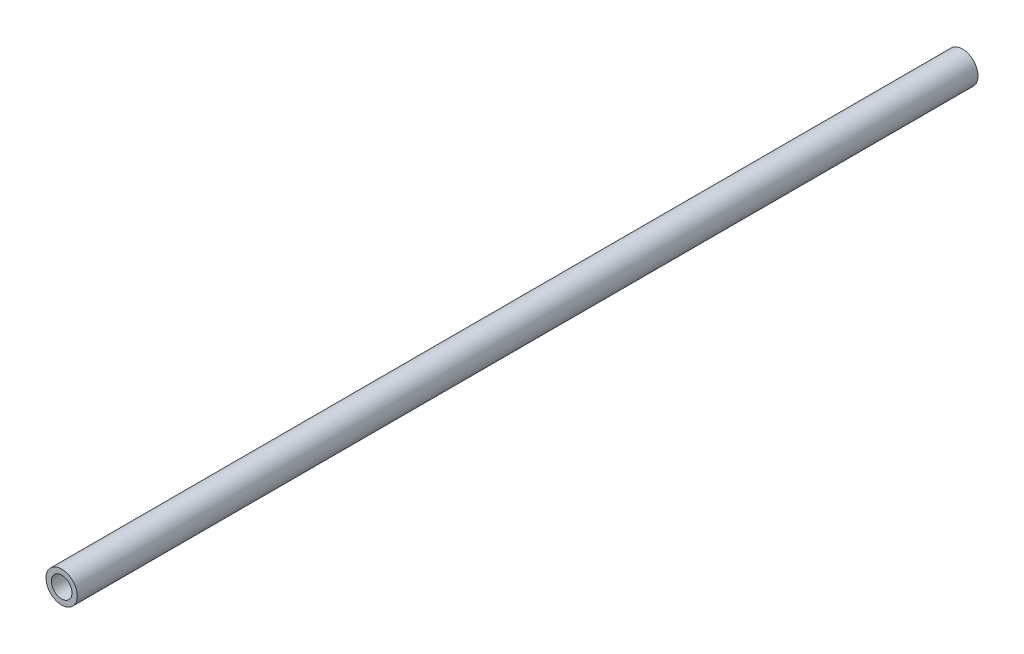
ISO-10303-21;
HEADER;
FILE_DESCRIPTION(('STEP AP214'),'2;1');
FILE_NAME('part.step','',(''),(''),'','','');
FILE_SCHEMA(('AUTOMOTIVE_DESIGN { 1 0 10303 214 1 1 1 1 }'));
ENDSEC;
DATA;
#1=APPLICATION_CONTEXT('core data for automotive mechanical design processes');
#2=APPLICATION_PROTOCOL_DEFINITION('international standard','automotive_design',2000,#1);
#3=PRODUCT_CONTEXT('',#1,'mechanical');
#4=PRODUCT('Part','Part','',(#3));
#5=PRODUCT_RELATED_PRODUCT_CATEGORY('part','',(#4));
#6=PRODUCT_DEFINITION_FORMATION('','',#4);
#7=PRODUCT_DEFINITION_CONTEXT('part definition',#1,'design');
#8=PRODUCT_DEFINITION('design','',#6,#7);
#9=PRODUCT_DEFINITION_SHAPE('','',#8);
#10=(LENGTH_UNIT() NAMED_UNIT(*) SI_UNIT(.MILLI.,.METRE.));
#11=(NAMED_UNIT(*) PLANE_ANGLE_UNIT() SI_UNIT($,.RADIAN.));
#12=(NAMED_UNIT(*) SI_UNIT($,.STERADIAN.) SOLID_ANGLE_UNIT());
#13=UNCERTAINTY_MEASURE_WITH_UNIT(LENGTH_MEASURE(1.E-05),#10,'distance_accuracy_value','');
#14=(GEOMETRIC_REPRESENTATION_CONTEXT(3) GLOBAL_UNCERTAINTY_ASSIGNED_CONTEXT((#13)) GLOBAL_UNIT_ASSIGNED_CONTEXT((#10,
#11,#12)) REPRESENTATION_CONTEXT('',''));
#15=CARTESIAN_POINT('',(0.,0.,0.));
#16=DIRECTION('',(0.,0.,1.));
#17=DIRECTION('',(1.,0.,0.));
#18=AXIS2_PLACEMENT_3D('',#15,#16,#17);
#19=CARTESIAN_POINT('',(0.,0.,217.));
#20=DIRECTION('',(0.,0.,-1.));
#21=DIRECTION('',(-1.,0.,0.));
#22=AXIS2_PLACEMENT_3D('',#19,#20,#21);
#23=CYLINDRICAL_SURFACE('',#22,2.5);
#24=CARTESIAN_POINT('',(0.,0.,217.));
#25=DIRECTION('',(0.,0.,1.));
#26=DIRECTION('',(1.,0.,0.));
#27=AXIS2_PLACEMENT_3D('',#24,#25,#26);
#28=CIRCLE('',#27,2.5);
#29=CARTESIAN_POINT('',(2.5,0.,217.));
#30=VERTEX_POINT('',#29);
#31=EDGE_CURVE('E11',#30,#30,#28,.T.);
#32=ORIENTED_EDGE('',*,*,#31,.F.);
#33=EDGE_LOOP('',(#32));
#34=FACE_BOUND('',#33,.T.);
#35=CARTESIAN_POINT('',(0.,0.,73.));
#36=DIRECTION('',(0.,0.,-1.));
#37=DIRECTION('',(-1.,0.,0.));
#38=AXIS2_PLACEMENT_3D('',#35,#36,#37);
#39=CIRCLE('',#38,2.5);
#40=CARTESIAN_POINT('',(-2.5,0.,73.));
#41=VERTEX_POINT('',#40);
#42=EDGE_CURVE('E36',#41,#41,#39,.T.);
#43=ORIENTED_EDGE('',*,*,#42,.F.);
#44=EDGE_LOOP('',(#43));
#45=FACE_BOUND('',#44,.T.);
#46=ADVANCED_FACE('F16',(#34,#45),#23,.T.);
#47=CARTESIAN_POINT('',(0.,0.,217.));
#48=DIRECTION('',(0.,0.,1.));
#49=DIRECTION('',(1.,0.,0.));
#50=AXIS2_PLACEMENT_3D('',#47,#48,#49);
#51=PLANE('',#50);
#52=CARTESIAN_POINT('',(0.,0.,217.));
#53=DIRECTION('',(0.,0.,1.));
#54=DIRECTION('',(1.,0.,0.));
#55=AXIS2_PLACEMENT_3D('',#52,#53,#54);
#56=CIRCLE('',#55,1.65);
#57=CARTESIAN_POINT('',(1.65,0.,217.));
#58=VERTEX_POINT('',#57);
#59=EDGE_CURVE('E34',#58,#58,#56,.T.);
#60=ORIENTED_EDGE('',*,*,#59,.F.);
#61=EDGE_LOOP('',(#60));
#62=FACE_BOUND('',#61,.T.);
#63=ORIENTED_EDGE('',*,*,#31,.T.);
#64=EDGE_LOOP('',(#63));
#65=FACE_BOUND('',#64,.T.);
#66=ADVANCED_FACE('F29',(#62,#65),#51,.T.);
#67=CARTESIAN_POINT('',(0.,0.,206.9));
#68=DIRECTION('',(0.,0.,1.));
#69=DIRECTION('',(1.,0.,0.));
#70=AXIS2_PLACEMENT_3D('',#67,#68,#69);
#71=CONICAL_SURFACE('',#70,1.65,1.02974425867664);
#72=CARTESIAN_POINT('',(0.,0.,205.908579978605));
#73=VERTEX_POINT('',#72);
#74=VERTEX_LOOP('',#73);
#75=FACE_BOUND('',#74,.T.);
#76=CARTESIAN_POINT('',(0.,0.,206.9));
#77=DIRECTION('',(0.,0.,1.));
#78=DIRECTION('',(1.,0.,0.));
#79=AXIS2_PLACEMENT_3D('',#76,#77,#78);
#80=CIRCLE('',#79,1.65);
#81=CARTESIAN_POINT('',(1.65,0.,206.9));
#82=VERTEX_POINT('',#81);
#83=EDGE_CURVE('E22',#82,#82,#80,.T.);
#84=ORIENTED_EDGE('',*,*,#83,.T.);
#85=EDGE_LOOP('',(#84));
#86=FACE_BOUND('',#85,.T.);
#87=ADVANCED_FACE('F25',(#75,#86),#71,.F.);
#88=CARTESIAN_POINT('',(0.,0.,217.));
#89=DIRECTION('',(0.,0.,1.));
#90=DIRECTION('',(1.,0.,0.));
#91=AXIS2_PLACEMENT_3D('',#88,#89,#90);
#92=CYLINDRICAL_SURFACE('',#91,1.65);
#93=ORIENTED_EDGE('',*,*,#83,.F.);
#94=EDGE_LOOP('',(#93));
#95=FACE_BOUND('',#94,.T.);
#96=ORIENTED_EDGE('',*,*,#59,.T.);
#97=EDGE_LOOP('',(#96));
#98=FACE_BOUND('',#97,.T.);
#99=ADVANCED_FACE('F28',(#95,#98),#92,.F.);
#100=CARTESIAN_POINT('',(0.,0.,73.));
#101=DIRECTION('',(0.,0.,-1.));
#102=DIRECTION('',(-1.,0.,0.));
#103=AXIS2_PLACEMENT_3D('',#100,#101,#102);
#104=PLANE('',#103);
#105=ORIENTED_EDGE('',*,*,#42,.T.);
#106=EDGE_LOOP('',(#105));
#107=FACE_BOUND('',#106,.T.);
#108=ADVANCED_FACE('F42',(#107),#104,.T.);
#109=CLOSED_SHELL('',(#46,#66,#87,#99,#108));
#110=MANIFOLD_SOLID_BREP('B1',#109);
#111=ADVANCED_BREP_SHAPE_REPRESENTATION('',(#18,#110),#14);
#112=SHAPE_DEFINITION_REPRESENTATION(#9,#111);
ENDSEC;
END-ISO-10303-21;
